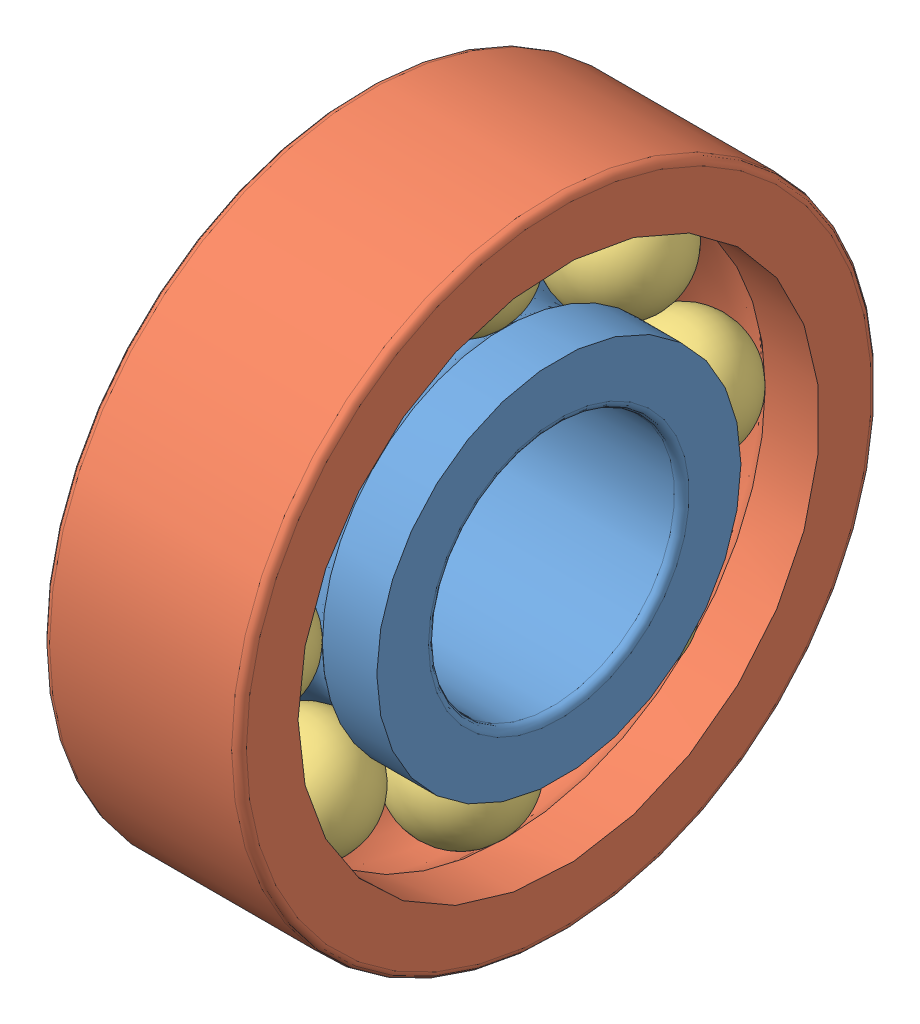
SolidWorks assembly Roulement galet.SLDASM, configuration Défaut (file format 7000). Lengths in mm.
Overall size (8 26 26).
10 component instances, 3 part files, 4 mates.
Components (placement in the parent):
- Roulement_r1rb_Bint22-1: Roulement_r1rb_Bint22.SLDPRT [Défaut] at origin size (8 14.8 14.8)
- Roulement_r1rb_Bext22-1: Roulement_r1rb_Bext22.SLDPRT [Défaut] at origin size (8 26 26)
- Roulement_r1rb_Eroul22-1: Roulement_r1rb_Eroul22.SLDPRT [Défaut] at (0.3 0 -5.3) size (4.8 4.8 4.8)
- Roulement_r1rb_Eroul22-2: Roulement_r1rb_Eroul22.SLDPRT [Défaut] at (0.3 3.7477 -3.7477) x (1 0 0) z (0 -0.707107 0.707107) size (4.8 4.8 4.8)
- Roulement_r1rb_Eroul22-3: Roulement_r1rb_Eroul22.SLDPRT [Défaut] at (0.3 5.3 0) x (1 0 0) z (0 -1 0) size (4.8 4.8 4.8)
- Roulement_r1rb_Eroul22-4: Roulement_r1rb_Eroul22.SLDPRT [Défaut] at (0.3 3.7477 3.7477) x (1 0 0) z (0 -0.707107 -0.707107) size (4.8 4.8 4.8)
- Roulement_r1rb_Eroul22-5: Roulement_r1rb_Eroul22.SLDPRT [Défaut] at (0.3 0 5.3) x (1 0 0) z (0 0 -1) size (4.8 4.8 4.8)
- Roulement_r1rb_Eroul22-6: Roulement_r1rb_Eroul22.SLDPRT [Défaut] at (0.3 -3.7477 3.7477) x (1 0 0) z (0 0.707107 -0.707107) size (4.8 4.8 4.8)
- Roulement_r1rb_Eroul22-7: Roulement_r1rb_Eroul22.SLDPRT [Défaut] at (0.3 -5.3 0) x (1 0 0) z (0 1 0) size (4.8 4.8 4.8)
- Roulement_r1rb_Eroul22-8: Roulement_r1rb_Eroul22.SLDPRT [Défaut] at (0.3 -3.7477 -3.7477) x (1 0 0) z (0 0.707107 0.707107) size (4.8 4.8 4.8)
Mates (geometry in assembly coordinates):
- Coïncidente1: coincident: point of ?
- Coïncidente2: coincident: unknown of ?
- Coïncidente4: coincident: point of Roulement_r1rb_Eroul22-1; point of assembly
- Parallèle1: parallel aligned: plane of Roulement_r1rb_Bint22-1 through (0 0 0) normal (1 0 0); plane of Roulement_r1rb_Bext22-1 through (0 0 0) normal (1 0 0)
